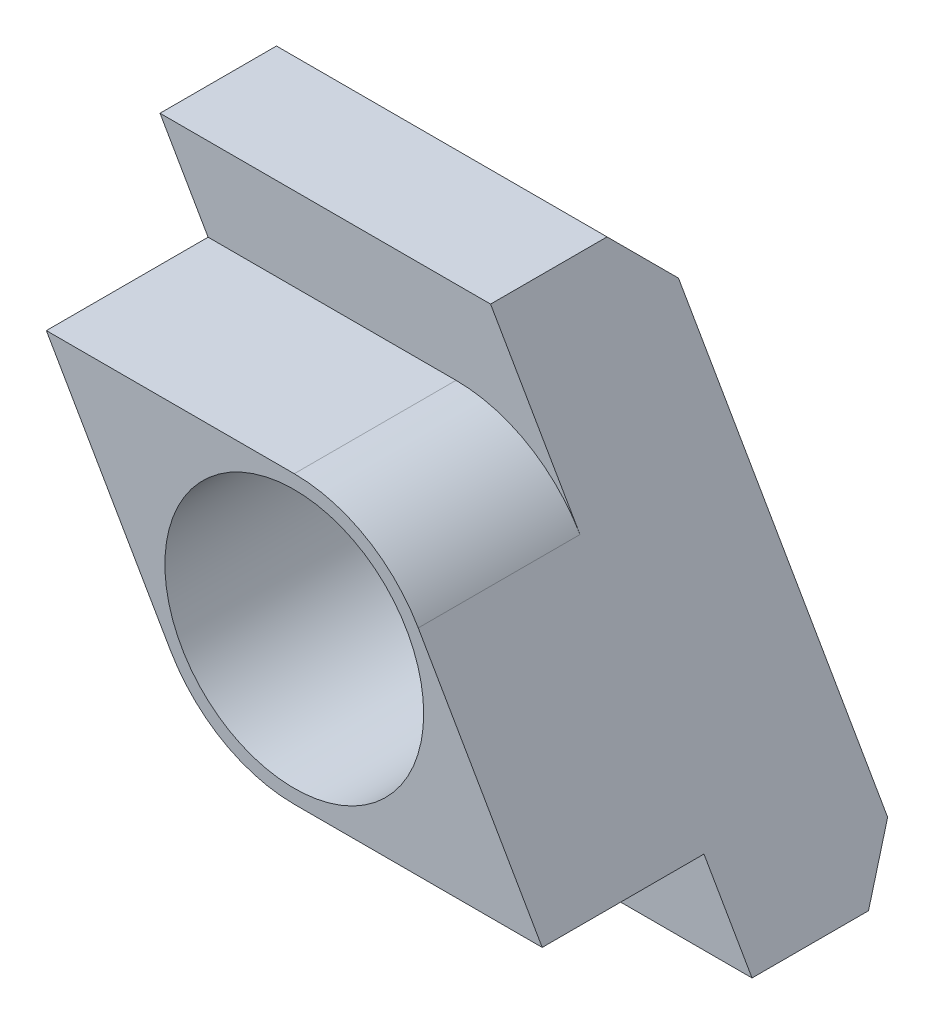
ISO-10303-21;
HEADER;
FILE_DESCRIPTION(('STEP AP214'),'2;1');
FILE_NAME('part.step','',(''),(''),'','','');
FILE_SCHEMA(('AUTOMOTIVE_DESIGN { 1 0 10303 214 1 1 1 1 }'));
ENDSEC;
DATA;
#1=APPLICATION_CONTEXT('core data for automotive mechanical design processes');
#2=APPLICATION_PROTOCOL_DEFINITION('international standard','automotive_design',2000,#1);
#3=PRODUCT_CONTEXT('',#1,'mechanical');
#4=PRODUCT('Part','Part','',(#3));
#5=PRODUCT_RELATED_PRODUCT_CATEGORY('part','',(#4));
#6=PRODUCT_DEFINITION_FORMATION('','',#4);
#7=PRODUCT_DEFINITION_CONTEXT('part definition',#1,'design');
#8=PRODUCT_DEFINITION('design','',#6,#7);
#9=PRODUCT_DEFINITION_SHAPE('','',#8);
#10=(LENGTH_UNIT() NAMED_UNIT(*) SI_UNIT(.MILLI.,.METRE.));
#11=(NAMED_UNIT(*) PLANE_ANGLE_UNIT() SI_UNIT($,.RADIAN.));
#12=(NAMED_UNIT(*) SI_UNIT($,.STERADIAN.) SOLID_ANGLE_UNIT());
#13=UNCERTAINTY_MEASURE_WITH_UNIT(LENGTH_MEASURE(1.E-05),#10,'distance_accuracy_value','');
#14=(GEOMETRIC_REPRESENTATION_CONTEXT(3) GLOBAL_UNCERTAINTY_ASSIGNED_CONTEXT((#13)) GLOBAL_UNIT_ASSIGNED_CONTEXT((#10,
#11,#12)) REPRESENTATION_CONTEXT('',''));
#15=CARTESIAN_POINT('',(0.,0.,0.));
#16=DIRECTION('',(0.,0.,1.));
#17=DIRECTION('',(1.,0.,0.));
#18=AXIS2_PLACEMENT_3D('',#15,#16,#17);
#19=CARTESIAN_POINT('',(3.49296636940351,8.85,0.));
#20=DIRECTION('',(0.,1.,0.));
#21=DIRECTION('',(-1.,0.,0.));
#22=AXIS2_PLACEMENT_3D('',#19,#20,#21);
#23=PLANE('',#22);
#24=DIRECTION('',(-1.,0.,0.));
#25=VECTOR('',#24,1.);
#26=CARTESIAN_POINT('',(15.3286425,8.85,10.));
#27=LINE('',#26,#25);
#28=CARTESIAN_POINT('',(0.,8.85,10.));
#29=VERTEX_POINT('',#28);
#30=CARTESIAN_POINT('',(-15.3286425,8.85,10.));
#31=VERTEX_POINT('',#30);
#32=EDGE_CURVE('E127',#29,#31,#27,.T.);
#33=ORIENTED_EDGE('',*,*,#32,.F.);
#34=DIRECTION('',(0.,0.,1.));
#35=VECTOR('',#34,1.);
#36=CARTESIAN_POINT('',(0.,8.84999845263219,-8.85));
#37=LINE('',#36,#35);
#38=CARTESIAN_POINT('',(0.,8.84999845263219,0.));
#39=VERTEX_POINT('',#38);
#40=EDGE_CURVE('E32',#39,#29,#37,.T.);
#41=ORIENTED_EDGE('',*,*,#40,.F.);
#42=DIRECTION('',(-1.,0.,0.));
#43=VECTOR('',#42,1.);
#44=CARTESIAN_POINT('',(-5.91783806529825,8.85,0.));
#45=LINE('',#44,#43);
#46=CARTESIAN_POINT('',(-15.3286425,8.85,0.));
#47=VERTEX_POINT('',#46);
#48=EDGE_CURVE('E18',#39,#47,#45,.T.);
#49=ORIENTED_EDGE('',*,*,#48,.T.);
#50=DIRECTION('',(0.,0.,1.));
#51=VECTOR('',#50,1.);
#52=CARTESIAN_POINT('',(-15.3286425,8.85,-10.));
#53=LINE('',#52,#51);
#54=EDGE_CURVE('E193',#31,#47,#53,.F.);
#55=ORIENTED_EDGE('',*,*,#54,.F.);
#56=EDGE_LOOP('',(#33,#41,#49,#55));
#57=FACE_BOUND('',#56,.T.);
#58=ADVANCED_FACE('F14',(#57),#23,.T.);
#59=CARTESIAN_POINT('',(-3.4929663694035,-8.85,0.));
#60=DIRECTION('',(0.,-1.,0.));
#61=DIRECTION('',(1.,0.,0.));
#62=AXIS2_PLACEMENT_3D('',#59,#60,#61);
#63=PLANE('',#62);
#64=DIRECTION('',(-1.,0.,0.));
#65=VECTOR('',#64,1.);
#66=CARTESIAN_POINT('',(15.3286425,-8.85,10.));
#67=LINE('',#66,#65);
#68=CARTESIAN_POINT('',(0.,-8.85,10.));
#69=VERTEX_POINT('',#68);
#70=CARTESIAN_POINT('',(15.3286425,-8.85,10.));
#71=VERTEX_POINT('',#70);
#72=EDGE_CURVE('E125',#69,#71,#67,.F.);
#73=ORIENTED_EDGE('',*,*,#72,.F.);
#74=DIRECTION('',(0.,0.,1.));
#75=VECTOR('',#74,1.);
#76=CARTESIAN_POINT('',(0.,-8.84999845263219,-8.85));
#77=LINE('',#76,#75);
#78=CARTESIAN_POINT('',(0.,-8.84999845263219,0.));
#79=VERTEX_POINT('',#78);
#80=EDGE_CURVE('E40',#79,#69,#77,.T.);
#81=ORIENTED_EDGE('',*,*,#80,.F.);
#82=DIRECTION('',(1.,0.,0.));
#83=VECTOR('',#82,1.);
#84=CARTESIAN_POINT('',(5.91783806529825,-8.85,0.));
#85=LINE('',#84,#83);
#86=CARTESIAN_POINT('',(15.3286425,-8.85,0.));
#87=VERTEX_POINT('',#86);
#88=EDGE_CURVE('E183',#79,#87,#85,.T.);
#89=ORIENTED_EDGE('',*,*,#88,.T.);
#90=DIRECTION('',(0.,0.,1.));
#91=VECTOR('',#90,1.);
#92=CARTESIAN_POINT('',(15.3286425,-8.85,-10.));
#93=LINE('',#92,#91);
#94=EDGE_CURVE('E216',#71,#87,#93,.F.);
#95=ORIENTED_EDGE('',*,*,#94,.F.);
#96=EDGE_LOOP('',(#73,#81,#89,#95));
#97=FACE_BOUND('',#96,.T.);
#98=ADVANCED_FACE('F347',(#97),#63,.T.);
#99=CARTESIAN_POINT('',(-18.301995,7.41166315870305,0.));
#100=DIRECTION('',(0.,0.,1.));
#101=DIRECTION('',(1.,0.,0.));
#102=AXIS2_PLACEMENT_3D('',#99,#100,#101);
#103=PLANE('',#102);
#104=ORIENTED_EDGE('',*,*,#48,.F.);
#105=CARTESIAN_POINT('',(0.,0.,0.));
#106=DIRECTION('',(0.,0.,1.));
#107=DIRECTION('',(1.,0.,0.));
#108=AXIS2_PLACEMENT_3D('',#105,#106,#107);
#109=CIRCLE('',#108,8.84999845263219);
#110=CARTESIAN_POINT('',(7.66432437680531,4.42499767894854,0.));
#111=VERTEX_POINT('',#110);
#112=EDGE_CURVE('E120',#111,#39,#109,.T.);
#113=ORIENTED_EDGE('',*,*,#112,.F.);
#114=DIRECTION('',(0.499999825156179,-0.866025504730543,0.));
#115=VECTOR('',#114,1.);
#116=CARTESIAN_POINT('',(10.219095,0.,0.));
#117=LINE('',#116,#115);
#118=CARTESIAN_POINT('',(2.136195,14.,0.));
#119=VERTEX_POINT('',#118);
#120=EDGE_CURVE('E118',#119,#111,#117,.T.);
#121=ORIENTED_EDGE('',*,*,#120,.F.);
#122=DIRECTION('',(-1.,0.,0.));
#123=VECTOR('',#122,1.);
#124=CARTESIAN_POINT('',(2.136195,14.,0.));
#125=LINE('',#124,#123);
#126=CARTESIAN_POINT('',(-18.301995,14.,0.));
#127=VERTEX_POINT('',#126);
#128=EDGE_CURVE('E229',#127,#119,#125,.F.);
#129=ORIENTED_EDGE('',*,*,#128,.F.);
#130=DIRECTION('',(-0.499999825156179,0.866025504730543,0.));
#131=VECTOR('',#130,1.);
#132=CARTESIAN_POINT('',(-10.219095,0.,0.));
#133=LINE('',#132,#131);
#134=EDGE_CURVE('E197',#47,#127,#133,.T.);
#135=ORIENTED_EDGE('',*,*,#134,.F.);
#136=EDGE_LOOP('',(#104,#113,#121,#129,#135));
#137=FACE_BOUND('',#136,.T.);
#138=ADVANCED_FACE('F16',(#137),#103,.T.);
#139=CARTESIAN_POINT('',(2.136195,14.,0.));
#140=DIRECTION('',(0.,1.,0.));
#141=DIRECTION('',(0.,0.,-1.));
#142=AXIS2_PLACEMENT_3D('',#139,#140,#141);
#143=PLANE('',#142);
#144=DIRECTION('',(-1.,0.,0.));
#145=VECTOR('',#144,1.);
#146=CARTESIAN_POINT('',(3.752775,14.,-7.2));
#147=LINE('',#146,#145);
#148=CARTESIAN_POINT('',(-18.301995,14.,-7.2));
#149=VERTEX_POINT('',#148);
#150=CARTESIAN_POINT('',(2.136195,14.,-7.2));
#151=VERTEX_POINT('',#150);
#152=EDGE_CURVE('E232',#149,#151,#147,.F.);
#153=ORIENTED_EDGE('',*,*,#152,.F.);
#154=DIRECTION('',(0.,0.,1.));
#155=VECTOR('',#154,1.);
#156=CARTESIAN_POINT('',(-18.301995,14.,-10.));
#157=LINE('',#156,#155);
#158=EDGE_CURVE('E200',#127,#149,#157,.F.);
#159=ORIENTED_EDGE('',*,*,#158,.F.);
#160=ORIENTED_EDGE('',*,*,#128,.T.);
#161=DIRECTION('',(0.,0.,1.));
#162=VECTOR('',#161,1.);
#163=CARTESIAN_POINT('',(2.136195,14.,-10.));
#164=LINE('',#163,#162);
#165=EDGE_CURVE('E217',#151,#119,#164,.T.);
#166=ORIENTED_EDGE('',*,*,#165,.F.);
#167=EDGE_LOOP('',(#153,#159,#160,#166));
#168=FACE_BOUND('',#167,.T.);
#169=ADVANCED_FACE('F360',(#168),#143,.T.);
#170=CARTESIAN_POINT('',(3.88510362,14.,-7.2));
#171=DIRECTION('',(0.,0.707106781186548,-0.707106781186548));
#172=DIRECTION('',(0.,-0.707106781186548,-0.707106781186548));
#173=AXIS2_PLACEMENT_3D('',#170,#171,#172);
#174=PLANE('',#173);
#175=CARTESIAN_POINT('',(3.752775,11.2,-10.));
#176=CARTESIAN_POINT('',(3.6854175,11.3166666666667,-9.88333333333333));
#177=CARTESIAN_POINT('',(3.61806,11.4333333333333,-9.76666666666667));
#178=CARTESIAN_POINT('',(3.483345,11.6666666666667,-9.53333333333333));
#179=CARTESIAN_POINT('',(3.4159875,11.7833333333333,-9.41666666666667));
#180=CARTESIAN_POINT('',(3.2812725,12.0166666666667,-9.18333333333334));
#181=CARTESIAN_POINT('',(3.213915,12.1333333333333,-9.06666666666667));
#182=CARTESIAN_POINT('',(3.0792,12.3666666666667,-8.83333333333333));
#183=CARTESIAN_POINT('',(3.0118425,12.4833333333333,-8.71666666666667));
#184=CARTESIAN_POINT('',(2.8771275,12.7166666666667,-8.48333333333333));
#185=CARTESIAN_POINT('',(2.80977,12.8333333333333,-8.36666666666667));
#186=CARTESIAN_POINT('',(2.675055,13.0666666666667,-8.13333333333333));
#187=CARTESIAN_POINT('',(2.6076975,13.1833333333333,-8.01666666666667));
#188=CARTESIAN_POINT('',(2.4729825,13.4166666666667,-7.78333333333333));
#189=CARTESIAN_POINT('',(2.405625,13.5333333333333,-7.66666666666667));
#190=CARTESIAN_POINT('',(2.27091,13.7666666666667,-7.43333333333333));
#191=CARTESIAN_POINT('',(2.2035525,13.8833333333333,-7.31666666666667));
#192=CARTESIAN_POINT('',(2.136195,14.,-7.2));
#193=B_SPLINE_CURVE_WITH_KNOTS('',3,(#175,#176,#177,#178,#179,#180,#181,#182,#183,#184,#185,
#186,#187,#188,#189,#190,#191,#192),.UNSPECIFIED.,.F.,.F.,(4,2,2,2,2,2,2,2,4),(0.,
0.534633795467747,1.0692675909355,1.60390138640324,2.13853518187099,2.67316897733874,
3.20780277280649,3.74243656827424,4.27707036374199),.UNSPECIFIED.);
#194=CARTESIAN_POINT('',(3.752775,11.2,-10.));
#195=VERTEX_POINT('',#194);
#196=EDGE_CURVE('E226',#195,#151,#193,.T.);
#197=ORIENTED_EDGE('',*,*,#196,.F.);
#198=DIRECTION('',(-1.,0.,0.));
#199=VECTOR('',#198,1.);
#200=CARTESIAN_POINT('',(16.685415,11.2,-10.));
#201=LINE('',#200,#199);
#202=CARTESIAN_POINT('',(-16.685415,11.2,-10.));
#203=VERTEX_POINT('',#202);
#204=EDGE_CURVE('E205',#203,#195,#201,.F.);
#205=ORIENTED_EDGE('',*,*,#204,.F.);
#206=CARTESIAN_POINT('',(-18.301995,14.,-7.2));
#207=CARTESIAN_POINT('',(-18.2346375,13.8833333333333,-7.31666666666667));
#208=CARTESIAN_POINT('',(-18.16728,13.7666666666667,-7.43333333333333));
#209=CARTESIAN_POINT('',(-18.032565,13.5333333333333,-7.66666666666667));
#210=CARTESIAN_POINT('',(-17.9652075,13.4166666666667,-7.78333333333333));
#211=CARTESIAN_POINT('',(-17.8304925,13.1833333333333,-8.01666666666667));
#212=CARTESIAN_POINT('',(-17.763135,13.0666666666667,-8.13333333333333));
#213=CARTESIAN_POINT('',(-17.62842,12.8333333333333,-8.36666666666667));
#214=CARTESIAN_POINT('',(-17.5610625,12.7166666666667,-8.48333333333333));
#215=CARTESIAN_POINT('',(-17.4263475,12.4833333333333,-8.71666666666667));
#216=CARTESIAN_POINT('',(-17.35899,12.3666666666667,-8.83333333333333));
#217=CARTESIAN_POINT('',(-17.224275,12.1333333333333,-9.06666666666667));
#218=CARTESIAN_POINT('',(-17.1569175,12.0166666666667,-9.18333333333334));
#219=CARTESIAN_POINT('',(-17.0222025,11.7833333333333,-9.41666666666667));
#220=CARTESIAN_POINT('',(-16.954845,11.6666666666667,-9.53333333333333));
#221=CARTESIAN_POINT('',(-16.82013,11.4333333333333,-9.76666666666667));
#222=CARTESIAN_POINT('',(-16.7527725,11.3166666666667,-9.88333333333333));
#223=CARTESIAN_POINT('',(-16.685415,11.2,-10.));
#224=B_SPLINE_CURVE_WITH_KNOTS('',3,(#206,#207,#208,#209,#210,#211,#212,#213,#214,#215,#216,
#217,#218,#219,#220,#221,#222,#223),.UNSPECIFIED.,.F.,.F.,(4,2,2,2,2,2,2,2,4),(0.,
0.534633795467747,1.0692675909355,1.60390138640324,2.13853518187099,2.67316897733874,
3.20780277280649,3.74243656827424,4.27707036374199),.UNSPECIFIED.);
#225=EDGE_CURVE('E294',#149,#203,#224,.T.);
#226=ORIENTED_EDGE('',*,*,#225,.F.);
#227=ORIENTED_EDGE('',*,*,#152,.T.);
#228=EDGE_LOOP('',(#197,#205,#226,#227));
#229=FACE_BOUND('',#228,.T.);
#230=ADVANCED_FACE('F358',(#229),#174,.T.);
#231=CARTESIAN_POINT('',(18.43432362,-11.2,-10.));
#232=DIRECTION('',(0.,-0.707106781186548,-0.707106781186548));
#233=DIRECTION('',(0.,-0.707106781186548,0.707106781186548));
#234=AXIS2_PLACEMENT_3D('',#231,#232,#233);
#235=PLANE('',#234);
#236=CARTESIAN_POINT('',(18.301995,-14.,-7.2));
#237=CARTESIAN_POINT('',(18.2346375,-13.8833333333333,-7.31666666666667));
#238=CARTESIAN_POINT('',(18.16728,-13.7666666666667,-7.43333333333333));
#239=CARTESIAN_POINT('',(18.032565,-13.5333333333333,-7.66666666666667));
#240=CARTESIAN_POINT('',(17.9652075,-13.4166666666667,-7.78333333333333));
#241=CARTESIAN_POINT('',(17.8304925,-13.1833333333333,-8.01666666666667));
#242=CARTESIAN_POINT('',(17.763135,-13.0666666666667,-8.13333333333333));
#243=CARTESIAN_POINT('',(17.62842,-12.8333333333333,-8.36666666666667));
#244=CARTESIAN_POINT('',(17.5610625,-12.7166666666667,-8.48333333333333));
#245=CARTESIAN_POINT('',(17.4263475,-12.4833333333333,-8.71666666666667));
#246=CARTESIAN_POINT('',(17.35899,-12.3666666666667,-8.83333333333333));
#247=CARTESIAN_POINT('',(17.224275,-12.1333333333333,-9.06666666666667));
#248=CARTESIAN_POINT('',(17.1569175,-12.0166666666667,-9.18333333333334));
#249=CARTESIAN_POINT('',(17.0222025,-11.7833333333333,-9.41666666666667));
#250=CARTESIAN_POINT('',(16.954845,-11.6666666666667,-9.53333333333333));
#251=CARTESIAN_POINT('',(16.82013,-11.4333333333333,-9.76666666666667));
#252=CARTESIAN_POINT('',(16.7527725,-11.3166666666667,-9.88333333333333));
#253=CARTESIAN_POINT('',(16.685415,-11.2,-10.));
#254=B_SPLINE_CURVE_WITH_KNOTS('',3,(#236,#237,#238,#239,#240,#241,#242,#243,#244,#245,#246,
#247,#248,#249,#250,#251,#252,#253),.UNSPECIFIED.,.F.,.F.,(4,2,2,2,2,2,2,2,4),(0.,
0.534633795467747,1.0692675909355,1.60390138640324,2.13853518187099,2.67316897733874,
3.20780277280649,3.74243656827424,4.27707036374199),.UNSPECIFIED.);
#255=CARTESIAN_POINT('',(18.301995,-14.,-7.2));
#256=VERTEX_POINT('',#255);
#257=CARTESIAN_POINT('',(16.685415,-11.2,-10.));
#258=VERTEX_POINT('',#257);
#259=EDGE_CURVE('E260',#256,#258,#254,.T.);
#260=ORIENTED_EDGE('',*,*,#259,.F.);
#261=DIRECTION('',(-1.,0.,0.));
#262=VECTOR('',#261,1.);
#263=CARTESIAN_POINT('',(18.301995,-14.,-7.2));
#264=LINE('',#263,#262);
#265=CARTESIAN_POINT('',(-2.136195,-14.,-7.2));
#266=VERTEX_POINT('',#265);
#267=EDGE_CURVE('E206',#266,#256,#264,.F.);
#268=ORIENTED_EDGE('',*,*,#267,.F.);
#269=CARTESIAN_POINT('',(-3.752775,-11.2,-10.));
#270=CARTESIAN_POINT('',(-3.6854175,-11.3166666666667,-9.88333333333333));
#271=CARTESIAN_POINT('',(-3.61806,-11.4333333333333,-9.76666666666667));
#272=CARTESIAN_POINT('',(-3.483345,-11.6666666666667,-9.53333333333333));
#273=CARTESIAN_POINT('',(-3.4159875,-11.7833333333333,-9.41666666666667));
#274=CARTESIAN_POINT('',(-3.2812725,-12.0166666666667,-9.18333333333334));
#275=CARTESIAN_POINT('',(-3.213915,-12.1333333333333,-9.06666666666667));
#276=CARTESIAN_POINT('',(-3.0792,-12.3666666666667,-8.83333333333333));
#277=CARTESIAN_POINT('',(-3.0118425,-12.4833333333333,-8.71666666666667));
#278=CARTESIAN_POINT('',(-2.8771275,-12.7166666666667,-8.48333333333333));
#279=CARTESIAN_POINT('',(-2.80977,-12.8333333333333,-8.36666666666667));
#280=CARTESIAN_POINT('',(-2.675055,-13.0666666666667,-8.13333333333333));
#281=CARTESIAN_POINT('',(-2.6076975,-13.1833333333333,-8.01666666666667));
#282=CARTESIAN_POINT('',(-2.4729825,-13.4166666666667,-7.78333333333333));
#283=CARTESIAN_POINT('',(-2.405625,-13.5333333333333,-7.66666666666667));
#284=CARTESIAN_POINT('',(-2.27091,-13.7666666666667,-7.43333333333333));
#285=CARTESIAN_POINT('',(-2.2035525,-13.8833333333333,-7.31666666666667));
#286=CARTESIAN_POINT('',(-2.136195,-14.,-7.2));
#287=B_SPLINE_CURVE_WITH_KNOTS('',3,(#269,#270,#271,#272,#273,#274,#275,#276,#277,#278,#279,
#280,#281,#282,#283,#284,#285,#286),.UNSPECIFIED.,.F.,.F.,(4,2,2,2,2,2,2,2,4),(0.,
0.534633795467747,1.0692675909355,1.60390138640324,2.13853518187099,2.67316897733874,
3.20780277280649,3.74243656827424,4.27707036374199),.UNSPECIFIED.);
#288=CARTESIAN_POINT('',(-3.752775,-11.2,-10.));
#289=VERTEX_POINT('',#288);
#290=EDGE_CURVE('E212',#289,#266,#287,.T.);
#291=ORIENTED_EDGE('',*,*,#290,.F.);
#292=DIRECTION('',(-1.,0.,0.));
#293=VECTOR('',#292,1.);
#294=CARTESIAN_POINT('',(16.685415,-11.2,-10.));
#295=LINE('',#294,#293);
#296=EDGE_CURVE('E186',#258,#289,#295,.T.);
#297=ORIENTED_EDGE('',*,*,#296,.F.);
#298=EDGE_LOOP('',(#260,#268,#291,#297));
#299=FACE_BOUND('',#298,.T.);
#300=ADVANCED_FACE('F320',(#299),#235,.T.);
#301=CARTESIAN_POINT('',(18.301995,-14.,-7.2));
#302=DIRECTION('',(0.,-1.,0.));
#303=DIRECTION('',(0.,0.,1.));
#304=AXIS2_PLACEMENT_3D('',#301,#302,#303);
#305=PLANE('',#304);
#306=ORIENTED_EDGE('',*,*,#267,.T.);
#307=DIRECTION('',(0.,0.,1.));
#308=VECTOR('',#307,1.);
#309=CARTESIAN_POINT('',(18.301995,-14.,-10.));
#310=LINE('',#309,#308);
#311=CARTESIAN_POINT('',(18.301995,-14.,0.));
#312=VERTEX_POINT('',#311);
#313=EDGE_CURVE('E222',#312,#256,#310,.F.);
#314=ORIENTED_EDGE('',*,*,#313,.F.);
#315=DIRECTION('',(1.,0.,0.));
#316=VECTOR('',#315,1.);
#317=CARTESIAN_POINT('',(6.19207860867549,-14.,0.));
#318=LINE('',#317,#316);
#319=CARTESIAN_POINT('',(-2.136195,-14.,0.));
#320=VERTEX_POINT('',#319);
#321=EDGE_CURVE('E203',#320,#312,#318,.T.);
#322=ORIENTED_EDGE('',*,*,#321,.F.);
#323=DIRECTION('',(0.,0.,1.));
#324=VECTOR('',#323,1.);
#325=CARTESIAN_POINT('',(-2.136195,-14.,-10.));
#326=LINE('',#325,#324);
#327=EDGE_CURVE('E209',#266,#320,#326,.T.);
#328=ORIENTED_EDGE('',*,*,#327,.F.);
#329=EDGE_LOOP('',(#306,#314,#322,#328));
#330=FACE_BOUND('',#329,.T.);
#331=ADVANCED_FACE('F325',(#330),#305,.T.);
#332=CARTESIAN_POINT('',(-5.91783778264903,-14.,0.));
#333=DIRECTION('',(0.,0.,1.));
#334=DIRECTION('',(1.,0.,0.));
#335=AXIS2_PLACEMENT_3D('',#332,#333,#334);
#336=PLANE('',#335);
#337=ORIENTED_EDGE('',*,*,#88,.F.);
#338=CARTESIAN_POINT('',(0.,0.,0.));
#339=DIRECTION('',(0.,0.,1.));
#340=DIRECTION('',(1.,0.,0.));
#341=AXIS2_PLACEMENT_3D('',#338,#339,#340);
#342=CIRCLE('',#341,8.84999845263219);
#343=CARTESIAN_POINT('',(-7.66432437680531,-4.42499767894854,0.));
#344=VERTEX_POINT('',#343);
#345=EDGE_CURVE('E233',#344,#79,#342,.T.);
#346=ORIENTED_EDGE('',*,*,#345,.F.);
#347=DIRECTION('',(-0.499999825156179,0.866025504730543,0.));
#348=VECTOR('',#347,1.);
#349=CARTESIAN_POINT('',(-10.219095,0.,0.));
#350=LINE('',#349,#348);
#351=EDGE_CURVE('E191',#320,#344,#350,.T.);
#352=ORIENTED_EDGE('',*,*,#351,.F.);
#353=ORIENTED_EDGE('',*,*,#321,.T.);
#354=DIRECTION('',(0.499999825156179,-0.866025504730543,0.));
#355=VECTOR('',#354,1.);
#356=CARTESIAN_POINT('',(10.219095,0.,0.));
#357=LINE('',#356,#355);
#358=EDGE_CURVE('E185',#87,#312,#357,.T.);
#359=ORIENTED_EDGE('',*,*,#358,.F.);
#360=EDGE_LOOP('',(#337,#346,#352,#353,#359));
#361=FACE_BOUND('',#360,.T.);
#362=ADVANCED_FACE('F332',(#361),#336,.T.);
#363=CARTESIAN_POINT('',(16.88563998,11.2,-10.));
#364=DIRECTION('',(0.,0.,-1.));
#365=DIRECTION('',(0.,-1.,0.));
#366=AXIS2_PLACEMENT_3D('',#363,#364,#365);
#367=PLANE('',#366);
#368=CARTESIAN_POINT('',(0.,0.,-10.));
#369=DIRECTION('',(0.,0.,-1.));
#370=DIRECTION('',(-1.,0.,0.));
#371=AXIS2_PLACEMENT_3D('',#368,#369,#370);
#372=CIRCLE('',#371,8.);
#373=CARTESIAN_POINT('',(-8.,0.,-10.));
#374=VERTEX_POINT('',#373);
#375=EDGE_CURVE('E129',#374,#374,#372,.T.);
#376=ORIENTED_EDGE('',*,*,#375,.F.);
#377=EDGE_LOOP('',(#376));
#378=FACE_BOUND('',#377,.T.);
#379=DIRECTION('',(-0.499999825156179,0.866025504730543,0.));
#380=VECTOR('',#379,1.);
#381=CARTESIAN_POINT('',(10.219095,0.,-10.));
#382=LINE('',#381,#380);
#383=EDGE_CURVE('E238',#258,#195,#382,.T.);
#384=ORIENTED_EDGE('',*,*,#383,.F.);
#385=ORIENTED_EDGE('',*,*,#296,.T.);
#386=DIRECTION('',(0.499999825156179,-0.866025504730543,0.));
#387=VECTOR('',#386,1.);
#388=CARTESIAN_POINT('',(-10.219095,0.,-10.));
#389=LINE('',#388,#387);
#390=EDGE_CURVE('E276',#203,#289,#389,.T.);
#391=ORIENTED_EDGE('',*,*,#390,.F.);
#392=ORIENTED_EDGE('',*,*,#204,.T.);
#393=EDGE_LOOP('',(#384,#385,#391,#392));
#394=FACE_BOUND('',#393,.T.);
#395=ADVANCED_FACE('F313',(#378,#394),#367,.T.);
#396=CARTESIAN_POINT('',(18.301995,-14.,-10.));
#397=DIRECTION('',(0.866025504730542,0.499999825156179,0.));
#398=DIRECTION('',(-0.499999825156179,0.866025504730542,0.));
#399=AXIS2_PLACEMENT_3D('',#396,#397,#398);
#400=PLANE('',#399);
#401=DIRECTION('',(0.,0.,1.));
#402=VECTOR('',#401,1.);
#403=CARTESIAN_POINT('',(7.66432303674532,4.4249969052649,-8.85));
#404=LINE('',#403,#402);
#405=CARTESIAN_POINT('',(7.66432303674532,4.4249969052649,10.));
#406=VERTEX_POINT('',#405);
#407=EDGE_CURVE('E107',#111,#406,#404,.T.);
#408=ORIENTED_EDGE('',*,*,#407,.T.);
#409=CARTESIAN_POINT('',(15.3286425,-8.85,10.));
#410=CARTESIAN_POINT('',(14.936525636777,-8.17083335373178,10.));
#411=CARTESIAN_POINT('',(14.5444087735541,-7.49166670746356,10.));
#412=CARTESIAN_POINT('',(13.7601750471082,-6.13333341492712,10.));
#413=CARTESIAN_POINT('',(13.3680581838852,-5.4541667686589,10.));
#414=CARTESIAN_POINT('',(12.5838244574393,-4.09583347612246,10.));
#415=CARTESIAN_POINT('',(12.1917075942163,-3.41666682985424,10.));
#416=CARTESIAN_POINT('',(11.4074738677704,-2.05833353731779,10.));
#417=CARTESIAN_POINT('',(11.0153570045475,-1.37916689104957,10.));
#418=CARTESIAN_POINT('',(10.2311232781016,-0.020833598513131,10.));
#419=CARTESIAN_POINT('',(9.8390064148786,0.658333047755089,10.));
#420=CARTESIAN_POINT('',(9.05477268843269,2.01666634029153,10.));
#421=CARTESIAN_POINT('',(8.66265582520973,2.69583298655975,10.));
#422=CARTESIAN_POINT('',(7.87842209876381,4.05416627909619,10.));
#423=CARTESIAN_POINT('',(7.48630523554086,4.73333292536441,10.));
#424=CARTESIAN_POINT('',(6.70207150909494,6.09166621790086,10.));
#425=CARTESIAN_POINT('',(6.30995464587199,6.77083286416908,10.));
#426=CARTESIAN_POINT('',(5.91783778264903,7.4499995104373,10.));
#427=B_SPLINE_CURVE_WITH_KNOTS('',3,(#409,#410,#411,#412,#413,#414,#415,#416,#417,#418,#419,
#420,#421,#422,#423,#424,#425,#426),.UNSPECIFIED.,.F.,.F.,(4,2,2,2,2,2,2,2,4),(0.,
2.35270200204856,4.70540400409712,7.05810600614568,9.41080800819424,11.7635100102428,
14.1162120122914,16.4689140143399,18.8216160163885),.UNSPECIFIED.);
#428=EDGE_CURVE('E116',#71,#406,#427,.T.);
#429=ORIENTED_EDGE('',*,*,#428,.F.);
#430=ORIENTED_EDGE('',*,*,#94,.T.);
#431=ORIENTED_EDGE('',*,*,#358,.T.);
#432=ORIENTED_EDGE('',*,*,#313,.T.);
#433=ORIENTED_EDGE('',*,*,#259,.T.);
#434=ORIENTED_EDGE('',*,*,#383,.T.);
#435=ORIENTED_EDGE('',*,*,#196,.T.);
#436=ORIENTED_EDGE('',*,*,#165,.T.);
#437=ORIENTED_EDGE('',*,*,#120,.T.);
#438=EDGE_LOOP('',(#408,#429,#430,#431,#432,#433,#434,#435,#436,#437));
#439=FACE_BOUND('',#438,.T.);
#440=ADVANCED_FACE('F114',(#439),#400,.T.);
#441=CARTESIAN_POINT('',(-18.301995,14.,-10.));
#442=DIRECTION('',(-0.866025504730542,-0.499999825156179,0.));
#443=DIRECTION('',(0.499999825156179,-0.866025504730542,0.));
#444=AXIS2_PLACEMENT_3D('',#441,#442,#443);
#445=PLANE('',#444);
#446=DIRECTION('',(0.,0.,1.));
#447=VECTOR('',#446,1.);
#448=CARTESIAN_POINT('',(-7.66432303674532,-4.4249969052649,-8.85));
#449=LINE('',#448,#447);
#450=CARTESIAN_POINT('',(-7.66432303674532,-4.4249969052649,10.));
#451=VERTEX_POINT('',#450);
#452=EDGE_CURVE('E329',#344,#451,#449,.T.);
#453=ORIENTED_EDGE('',*,*,#452,.T.);
#454=CARTESIAN_POINT('',(-15.3286425,8.85,10.));
#455=CARTESIAN_POINT('',(-14.936525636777,8.17083335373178,10.));
#456=CARTESIAN_POINT('',(-14.5444087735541,7.49166670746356,10.));
#457=CARTESIAN_POINT('',(-13.7601750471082,6.13333341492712,10.));
#458=CARTESIAN_POINT('',(-13.3680581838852,5.4541667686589,10.));
#459=CARTESIAN_POINT('',(-12.5838244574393,4.09583347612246,10.));
#460=CARTESIAN_POINT('',(-12.1917075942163,3.41666682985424,10.));
#461=CARTESIAN_POINT('',(-11.4074738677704,2.0583335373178,10.));
#462=CARTESIAN_POINT('',(-11.0153570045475,1.37916689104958,10.));
#463=CARTESIAN_POINT('',(-10.2311232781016,0.0208335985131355,10.));
#464=CARTESIAN_POINT('',(-9.83900641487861,-0.658333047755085,10.));
#465=CARTESIAN_POINT('',(-9.0547726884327,-2.01666634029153,10.));
#466=CARTESIAN_POINT('',(-8.66265582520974,-2.69583298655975,10.));
#467=CARTESIAN_POINT('',(-7.87842209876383,-4.05416627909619,10.));
#468=CARTESIAN_POINT('',(-7.48630523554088,-4.73333292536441,10.));
#469=CARTESIAN_POINT('',(-6.70207150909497,-6.09166621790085,10.));
#470=CARTESIAN_POINT('',(-6.30995464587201,-6.77083286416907,10.));
#471=CARTESIAN_POINT('',(-5.91783778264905,-7.44999951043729,10.));
#472=B_SPLINE_CURVE_WITH_KNOTS('',3,(#454,#455,#456,#457,#458,#459,#460,#461,#462,#463,#464,
#465,#466,#467,#468,#469,#470,#471),.UNSPECIFIED.,.F.,.F.,(4,2,2,2,2,2,2,2,4),(0.,
2.35270200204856,4.70540400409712,7.05810600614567,9.41080800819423,11.7635100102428,
14.1162120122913,16.4689140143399,18.8216160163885),.UNSPECIFIED.);
#473=EDGE_CURVE('E24',#31,#451,#472,.T.);
#474=ORIENTED_EDGE('',*,*,#473,.F.);
#475=ORIENTED_EDGE('',*,*,#54,.T.);
#476=ORIENTED_EDGE('',*,*,#134,.T.);
#477=ORIENTED_EDGE('',*,*,#158,.T.);
#478=ORIENTED_EDGE('',*,*,#225,.T.);
#479=ORIENTED_EDGE('',*,*,#390,.T.);
#480=ORIENTED_EDGE('',*,*,#290,.T.);
#481=ORIENTED_EDGE('',*,*,#327,.T.);
#482=ORIENTED_EDGE('',*,*,#351,.T.);
#483=EDGE_LOOP('',(#453,#474,#475,#476,#477,#478,#479,#480,#481,#482));
#484=FACE_BOUND('',#483,.T.);
#485=ADVANCED_FACE('F287',(#484),#445,.T.);
#486=CARTESIAN_POINT('',(15.51258621,-8.85,10.));
#487=DIRECTION('',(0.,0.,1.));
#488=DIRECTION('',(0.,1.,0.));
#489=AXIS2_PLACEMENT_3D('',#486,#487,#488);
#490=PLANE('',#489);
#491=CARTESIAN_POINT('',(0.,0.,10.));
#492=DIRECTION('',(0.,0.,-1.));
#493=DIRECTION('',(1.,0.,0.));
#494=AXIS2_PLACEMENT_3D('',#491,#492,#493);
#495=CIRCLE('',#494,8.84999845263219);
#496=EDGE_CURVE('E104',#29,#406,#495,.T.);
#497=ORIENTED_EDGE('',*,*,#496,.F.);
#498=ORIENTED_EDGE('',*,*,#32,.T.);
#499=ORIENTED_EDGE('',*,*,#473,.T.);
#500=CARTESIAN_POINT('',(0.,0.,10.));
#501=DIRECTION('',(0.,0.,-1.));
#502=DIRECTION('',(1.,0.,0.));
#503=AXIS2_PLACEMENT_3D('',#500,#501,#502);
#504=CIRCLE('',#503,8.84999845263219);
#505=EDGE_CURVE('E336',#69,#451,#504,.T.);
#506=ORIENTED_EDGE('',*,*,#505,.F.);
#507=ORIENTED_EDGE('',*,*,#72,.T.);
#508=ORIENTED_EDGE('',*,*,#428,.T.);
#509=EDGE_LOOP('',(#497,#498,#499,#506,#507,#508));
#510=FACE_BOUND('',#509,.T.);
#511=CARTESIAN_POINT('',(0.,0.,10.));
#512=DIRECTION('',(0.,0.,1.));
#513=DIRECTION('',(1.,0.,0.));
#514=AXIS2_PLACEMENT_3D('',#511,#512,#513);
#515=CIRCLE('',#514,8.);
#516=CARTESIAN_POINT('',(8.,0.,10.));
#517=VERTEX_POINT('',#516);
#518=EDGE_CURVE('E9',#517,#517,#515,.T.);
#519=ORIENTED_EDGE('',*,*,#518,.F.);
#520=EDGE_LOOP('',(#519));
#521=FACE_BOUND('',#520,.T.);
#522=ADVANCED_FACE('F122',(#510,#521),#490,.T.);
#523=CARTESIAN_POINT('',(0.,0.,-10.0001030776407));
#524=DIRECTION('',(0.,0.,1.));
#525=DIRECTION('',(1.,0.,0.));
#526=AXIS2_PLACEMENT_3D('',#523,#524,#525);
#527=CYLINDRICAL_SURFACE('',#526,8.);
#528=ORIENTED_EDGE('',*,*,#375,.T.);
#529=EDGE_LOOP('',(#528));
#530=FACE_BOUND('',#529,.T.);
#531=ORIENTED_EDGE('',*,*,#518,.T.);
#532=EDGE_LOOP('',(#531));
#533=FACE_BOUND('',#532,.T.);
#534=ADVANCED_FACE('F152',(#530,#533),#527,.F.);
#535=CARTESIAN_POINT('',(0.,0.,-8.85));
#536=DIRECTION('',(0.,0.,1.));
#537=DIRECTION('',(1.,0.,0.));
#538=AXIS2_PLACEMENT_3D('',#535,#536,#537);
#539=CYLINDRICAL_SURFACE('',#538,8.84999845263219);
#540=ORIENTED_EDGE('',*,*,#345,.T.);
#541=ORIENTED_EDGE('',*,*,#80,.T.);
#542=ORIENTED_EDGE('',*,*,#505,.T.);
#543=ORIENTED_EDGE('',*,*,#452,.F.);
#544=EDGE_LOOP('',(#540,#541,#542,#543));
#545=FACE_BOUND('',#544,.T.);
#546=ADVANCED_FACE('F335',(#545),#539,.T.);
#547=CARTESIAN_POINT('',(0.,0.,-8.85));
#548=DIRECTION('',(0.,0.,1.));
#549=DIRECTION('',(1.,0.,0.));
#550=AXIS2_PLACEMENT_3D('',#547,#548,#549);
#551=CYLINDRICAL_SURFACE('',#550,8.84999845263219);
#552=ORIENTED_EDGE('',*,*,#112,.T.);
#553=ORIENTED_EDGE('',*,*,#40,.T.);
#554=ORIENTED_EDGE('',*,*,#496,.T.);
#555=ORIENTED_EDGE('',*,*,#407,.F.);
#556=EDGE_LOOP('',(#552,#553,#554,#555));
#557=FACE_BOUND('',#556,.T.);
#558=ADVANCED_FACE('F106',(#557),#551,.T.);
#559=CLOSED_SHELL('',(#58,#98,#138,#169,#230,#300,#331,#362,#395,#440,#485,#522,#534,#546,#558));
#560=MANIFOLD_SOLID_BREP('B1',#559);
#561=ADVANCED_BREP_SHAPE_REPRESENTATION('',(#18,#560),#14);
#562=SHAPE_DEFINITION_REPRESENTATION(#9,#561);
ENDSEC;
END-ISO-10303-21;
